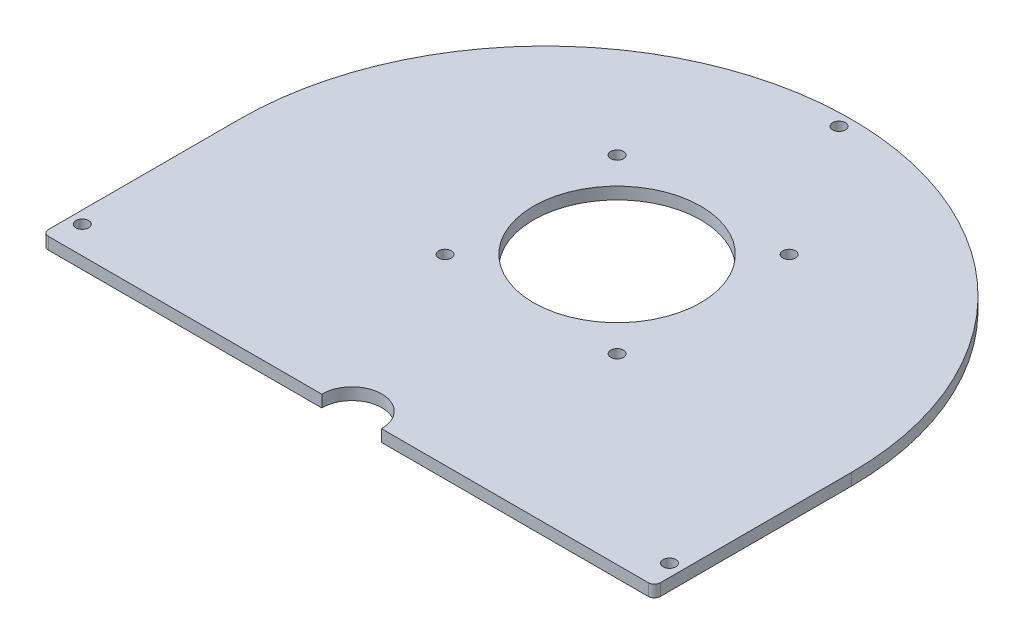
from build123d import *

# Parameters (mm, degrees)
BOSS_EXTRUDE1_DEPTH     = 6.35
F_1_4_CLEARANCE_HOLE1_D = 6.7564
SKETCH8_R               = 44.45
CUT_EXTRUDE1_DEPTH      = 230.982237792
FILLET1_R               = 3.175
F_1_4_CLEARANCE_HOLE2_D = 6.7564
SKETCH11_R              = 15.875
CUT_EXTRUDE2_DEPTH      = 230.982237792


with BuildPart() as part:
    # Sketch1 → Boss-Extrude1 (new body)
    with BuildSketch(Plane(origin=(0, 0, 0), x_dir=(1, 0, 0), z_dir=(0, 1, 0))):
        with BuildLine():
            Line((-162.56, -104.6734), (162.56, -104.6734))
            Line((162.56, -104.6734), (162.56, 0))
            ThreePointArc((162.56, 0), (0, 162.56), (-162.56, 0))
            Line((-162.56, 0), (-162.56, -104.6734))
        make_face()
    extrude(amount=BOSS_EXTRUDE1_DEPTH)

    # 1_4 Clearance Hole1 (through all)
    with Locations(Plane(origin=(0, 6.35, 0), x_dir=(1, 0, 0), z_dir=(0, 1, 0))):
        with Locations((0, 156.0068), (-156.0068, -90.0684), (156.0068, -90.0684)):
            Hole(F_1_4_CLEARANCE_HOLE1_D / 2)

    # Sketch8 → Cut-Extrude1 (cut, through all)
    with BuildSketch(Plane(origin=(0, 6.35, 0), x_dir=(1, 0, 0), z_dir=(0, 1, 0))):
        with Locations(Location((0, 38.1, 0), (0, 0, 270))):
            Circle(SKETCH8_R)
    extrude(amount=-CUT_EXTRUDE1_DEPTH, mode=Mode.SUBTRACT)

    # Fillet1
    fillet1_edges = [part.edges().sort_by_distance(p)[0] for p in [
        (162.56, 3.175, 104.6734),
        (-162.56, 3.175, 104.6734),
    ]]
    fillet(fillet1_edges, radius=FILLET1_R)

    # 1_4 Clearance Hole2 (through all)
    with Locations(Plane(origin=(0, 0, 0), x_dir=(-1, 0, 0), z_dir=(0, -1, 0))):
        with Locations((-45.72, 83.82), (45.72, 83.82), (45.72, -7.62), (-45.72, -7.62)):
            Hole(F_1_4_CLEARANCE_HOLE2_D / 2)

    # Sketch11 → Cut-Extrude2 (cut, through all)
    with BuildSketch(Plane(origin=(0, 6.35, 0), x_dir=(1, 0, 0), z_dir=(0, 1, 0))):
        with Locations((1.7125, -104.475)):
            Circle(SKETCH11_R)
    extrude(amount=-CUT_EXTRUDE2_DEPTH, mode=Mode.SUBTRACT)


solid = part.part
